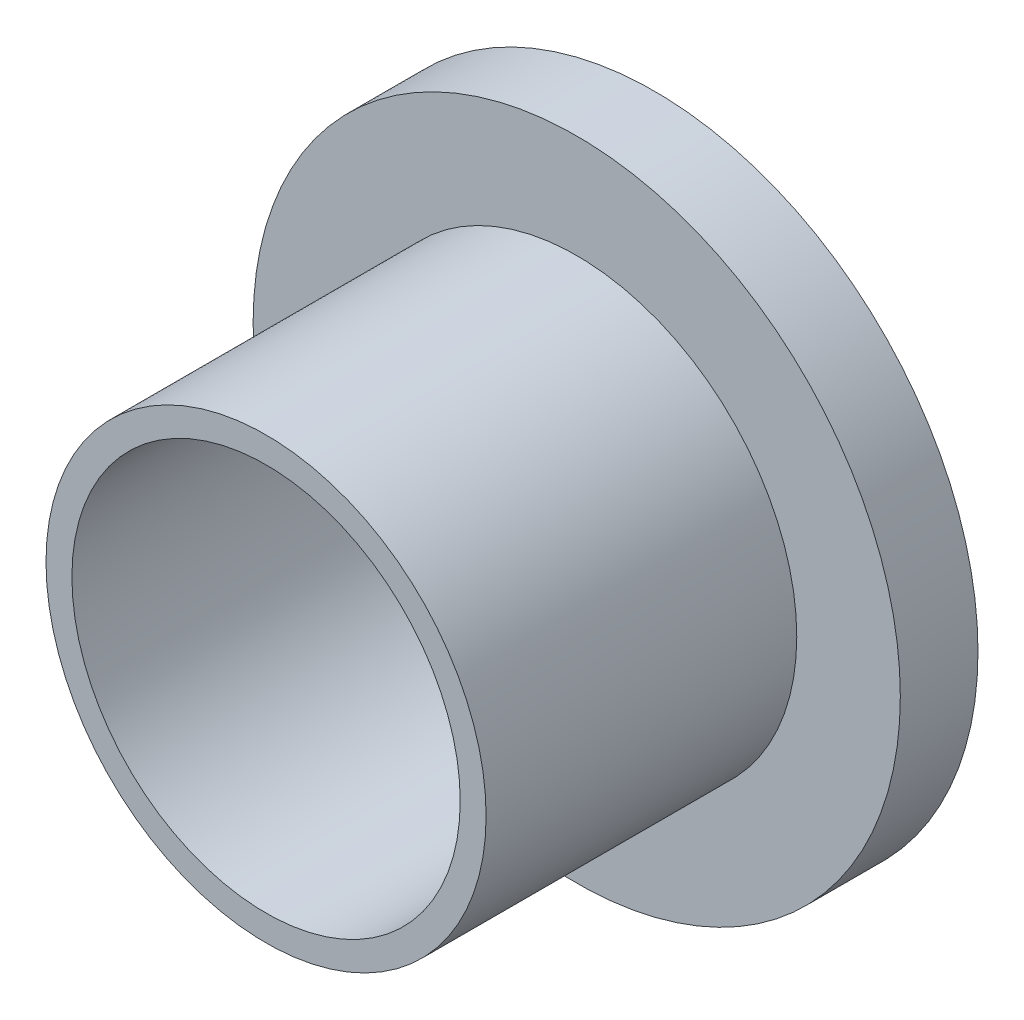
ISO-10303-21;
HEADER;
FILE_DESCRIPTION(('STEP AP214'),'2;1');
FILE_NAME('part.step','',(''),(''),'','','');
FILE_SCHEMA(('AUTOMOTIVE_DESIGN { 1 0 10303 214 1 1 1 1 }'));
ENDSEC;
DATA;
#1=APPLICATION_CONTEXT('core data for automotive mechanical design processes');
#2=APPLICATION_PROTOCOL_DEFINITION('international standard','automotive_design',2000,#1);
#3=PRODUCT_CONTEXT('',#1,'mechanical');
#4=PRODUCT('Part','Part','',(#3));
#5=PRODUCT_RELATED_PRODUCT_CATEGORY('part','',(#4));
#6=PRODUCT_DEFINITION_FORMATION('','',#4);
#7=PRODUCT_DEFINITION_CONTEXT('part definition',#1,'design');
#8=PRODUCT_DEFINITION('design','',#6,#7);
#9=PRODUCT_DEFINITION_SHAPE('','',#8);
#10=(LENGTH_UNIT() NAMED_UNIT(*) SI_UNIT(.MILLI.,.METRE.));
#11=(NAMED_UNIT(*) PLANE_ANGLE_UNIT() SI_UNIT($,.RADIAN.));
#12=(NAMED_UNIT(*) SI_UNIT($,.STERADIAN.) SOLID_ANGLE_UNIT());
#13=UNCERTAINTY_MEASURE_WITH_UNIT(LENGTH_MEASURE(1.E-05),#10,'distance_accuracy_value','');
#14=(GEOMETRIC_REPRESENTATION_CONTEXT(3) GLOBAL_UNCERTAINTY_ASSIGNED_CONTEXT((#13)) GLOBAL_UNIT_ASSIGNED_CONTEXT((#10,
#11,#12)) REPRESENTATION_CONTEXT('',''));
#15=CARTESIAN_POINT('',(0.,0.,0.));
#16=DIRECTION('',(0.,0.,1.));
#17=DIRECTION('',(1.,0.,0.));
#18=AXIS2_PLACEMENT_3D('',#15,#16,#17);
#19=CARTESIAN_POINT('',(0.,0.,12.));
#20=DIRECTION('',(0.,0.,1.));
#21=DIRECTION('',(1.,0.,0.));
#22=AXIS2_PLACEMENT_3D('',#19,#20,#21);
#23=PLANE('',#22);
#24=CARTESIAN_POINT('',(0.,0.,12.));
#25=DIRECTION('',(0.,0.,1.));
#26=DIRECTION('',(1.,0.,0.));
#27=AXIS2_PLACEMENT_3D('',#24,#25,#26);
#28=CIRCLE('',#27,8.5);
#29=CARTESIAN_POINT('',(8.5,0.,12.));
#30=VERTEX_POINT('',#29);
#31=EDGE_CURVE('E10',#30,#30,#28,.T.);
#32=ORIENTED_EDGE('',*,*,#31,.T.);
#33=EDGE_LOOP('',(#32));
#34=FACE_BOUND('',#33,.T.);
#35=CARTESIAN_POINT('',(0.,0.,12.));
#36=DIRECTION('',(0.,0.,1.));
#37=DIRECTION('',(1.,0.,0.));
#38=AXIS2_PLACEMENT_3D('',#35,#36,#37);
#39=CIRCLE('',#38,7.5);
#40=CARTESIAN_POINT('',(7.5,0.,12.));
#41=VERTEX_POINT('',#40);
#42=EDGE_CURVE('E51',#41,#41,#39,.T.);
#43=ORIENTED_EDGE('',*,*,#42,.F.);
#44=EDGE_LOOP('',(#43));
#45=FACE_BOUND('',#44,.T.);
#46=ADVANCED_FACE('F43',(#34,#45),#23,.T.);
#47=CARTESIAN_POINT('',(0.,0.,12.));
#48=DIRECTION('',(0.,0.,-1.));
#49=DIRECTION('',(-1.,0.,0.));
#50=AXIS2_PLACEMENT_3D('',#47,#48,#49);
#51=CYLINDRICAL_SURFACE('',#50,8.5);
#52=ORIENTED_EDGE('',*,*,#31,.F.);
#53=EDGE_LOOP('',(#52));
#54=FACE_BOUND('',#53,.T.);
#55=CARTESIAN_POINT('',(0.,0.,0.));
#56=DIRECTION('',(0.,0.,1.));
#57=DIRECTION('',(1.,0.,0.));
#58=AXIS2_PLACEMENT_3D('',#55,#56,#57);
#59=CIRCLE('',#58,8.5);
#60=CARTESIAN_POINT('',(8.5,0.,0.));
#61=VERTEX_POINT('',#60);
#62=EDGE_CURVE('E50',#61,#61,#59,.T.);
#63=ORIENTED_EDGE('',*,*,#62,.T.);
#64=EDGE_LOOP('',(#63));
#65=FACE_BOUND('',#64,.T.);
#66=ADVANCED_FACE('F44',(#54,#65),#51,.T.);
#67=CARTESIAN_POINT('',(0.,0.,12.));
#68=DIRECTION('',(0.,0.,-1.));
#69=DIRECTION('',(-1.,0.,0.));
#70=AXIS2_PLACEMENT_3D('',#67,#68,#69);
#71=CYLINDRICAL_SURFACE('',#70,7.5);
#72=ORIENTED_EDGE('',*,*,#42,.T.);
#73=EDGE_LOOP('',(#72));
#74=FACE_BOUND('',#73,.T.);
#75=CARTESIAN_POINT('',(0.,0.,-3.));
#76=DIRECTION('',(0.,0.,-1.));
#77=DIRECTION('',(-1.,0.,0.));
#78=AXIS2_PLACEMENT_3D('',#75,#76,#77);
#79=CIRCLE('',#78,7.5);
#80=CARTESIAN_POINT('',(-7.5,0.,-3.));
#81=VERTEX_POINT('',#80);
#82=EDGE_CURVE('E63',#81,#81,#79,.T.);
#83=ORIENTED_EDGE('',*,*,#82,.T.);
#84=EDGE_LOOP('',(#83));
#85=FACE_BOUND('',#84,.T.);
#86=ADVANCED_FACE('F70',(#74,#85),#71,.F.);
#87=CARTESIAN_POINT('',(0.,0.,-3.));
#88=DIRECTION('',(0.,0.,-1.));
#89=DIRECTION('',(-1.,0.,0.));
#90=AXIS2_PLACEMENT_3D('',#87,#88,#89);
#91=PLANE('',#90);
#92=CARTESIAN_POINT('',(0.,0.,-3.));
#93=DIRECTION('',(0.,0.,-1.));
#94=DIRECTION('',(-1.,0.,0.));
#95=AXIS2_PLACEMENT_3D('',#92,#93,#94);
#96=CIRCLE('',#95,12.5);
#97=CARTESIAN_POINT('',(-12.5,0.,-3.));
#98=VERTEX_POINT('',#97);
#99=EDGE_CURVE('E58',#98,#98,#96,.T.);
#100=ORIENTED_EDGE('',*,*,#99,.T.);
#101=EDGE_LOOP('',(#100));
#102=FACE_BOUND('',#101,.T.);
#103=ORIENTED_EDGE('',*,*,#82,.F.);
#104=EDGE_LOOP('',(#103));
#105=FACE_BOUND('',#104,.T.);
#106=ADVANCED_FACE('F69',(#102,#105),#91,.T.);
#107=CARTESIAN_POINT('',(0.,0.,0.));
#108=DIRECTION('',(0.,0.,-1.));
#109=DIRECTION('',(-1.,0.,0.));
#110=AXIS2_PLACEMENT_3D('',#107,#108,#109);
#111=PLANE('',#110);
#112=ORIENTED_EDGE('',*,*,#62,.F.);
#113=EDGE_LOOP('',(#112));
#114=FACE_BOUND('',#113,.T.);
#115=CARTESIAN_POINT('',(0.,0.,0.));
#116=DIRECTION('',(0.,0.,-1.));
#117=DIRECTION('',(-1.,0.,0.));
#118=AXIS2_PLACEMENT_3D('',#115,#116,#117);
#119=CIRCLE('',#118,12.5);
#120=CARTESIAN_POINT('',(-12.5,0.,0.));
#121=VERTEX_POINT('',#120);
#122=EDGE_CURVE('E60',#121,#121,#119,.T.);
#123=ORIENTED_EDGE('',*,*,#122,.F.);
#124=EDGE_LOOP('',(#123));
#125=FACE_BOUND('',#124,.T.);
#126=ADVANCED_FACE('F73',(#114,#125),#111,.F.);
#127=CARTESIAN_POINT('',(0.,0.,-3.));
#128=DIRECTION('',(0.,0.,1.));
#129=DIRECTION('',(1.,0.,0.));
#130=AXIS2_PLACEMENT_3D('',#127,#128,#129);
#131=CYLINDRICAL_SURFACE('',#130,12.5);
#132=ORIENTED_EDGE('',*,*,#99,.F.);
#133=EDGE_LOOP('',(#132));
#134=FACE_BOUND('',#133,.T.);
#135=ORIENTED_EDGE('',*,*,#122,.T.);
#136=EDGE_LOOP('',(#135));
#137=FACE_BOUND('',#136,.T.);
#138=ADVANCED_FACE('F76',(#134,#137),#131,.T.);
#139=CLOSED_SHELL('',(#46,#66,#86,#106,#126,#138));
#140=MANIFOLD_SOLID_BREP('B2',#139);
#141=ADVANCED_BREP_SHAPE_REPRESENTATION('',(#18,#140),#14);
#142=SHAPE_DEFINITION_REPRESENTATION(#9,#141);
ENDSEC;
END-ISO-10303-21;
